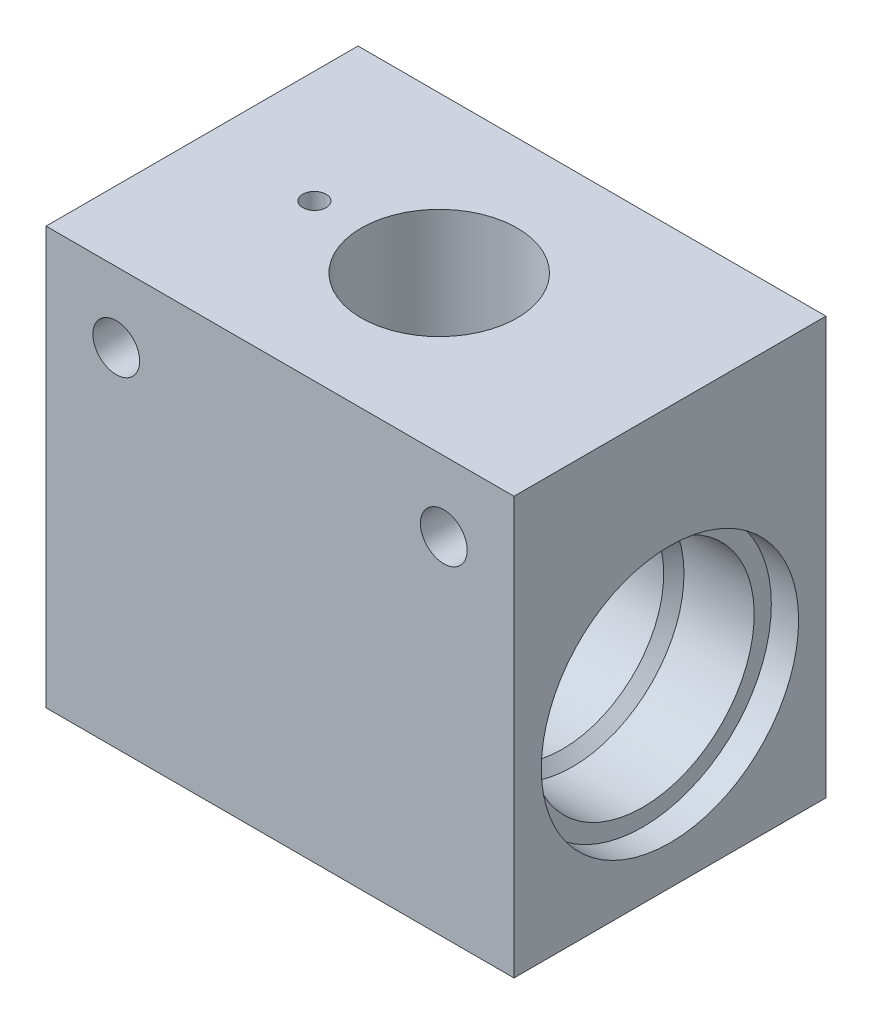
from build123d import *

# Parameters (mm, degrees)
BASE_EXTRUSION_DEPTH      = 20
BASE_EXTRUSION_DEPTH_BACK = 20
ESQUISSE1_W               = 60
ESQUISSE1_H               = 53.5
ESQUISSE3_R               = 16.5
ENL_V_MAT_EXTRU_1_DEPTH   = 3.5
ENL_V_START               = -3.5
ESQUISSE4_R               = 16.5
ENL_V_MAT_EXTRU_2_DEPTH   = 3.5
ESQUISSE6_R               = 13
ENL_V_MAT_EXTRU_3_DEPTH   = 81.339902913
ESQUISSE7_R               = 10
ENL_V_MAT_EXTRU_4_DEPTH   = 15
ESQUISSE8_R               = 14
ENL_V_MAT_EXTRU_5_DEPTH   = 17
ESQUISSE9_R               = 3
ENL_V_MAT_EXTRU_6_DEPTH   = 90.790032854
PER_AGE_D3_D              = 3
PER_AGE_D3_DEPTH          = 5
PER_AGE_D3_TIP            = 0.901290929


with BuildPart() as part:
    # Esquisse1 → Base-Extrusion (new, two sides: drawn at the far end of the back side and taken through both)
    with BuildSketch(Plane.XY.offset(-BASE_EXTRUSION_DEPTH_BACK)):
        with Locations((30, 26.75)):
            Rectangle(ESQUISSE1_W, ESQUISSE1_H)
    extrude(amount=BASE_EXTRUSION_DEPTH + BASE_EXTRUSION_DEPTH_BACK)

    # Esquisse3 → Enl_v. mat.-Extru.1 (cut)
    with BuildSketch(Plane.ZY):
        with Locations((0, 21.5)):
            Circle(ESQUISSE3_R)
    extrude(amount=-ENL_V_MAT_EXTRU_1_DEPTH, mode=Mode.SUBTRACT)

    # Esquisse4 → Enl_v. mat.-Extru.2 (cut)
    with BuildSketch(Plane(origin=(60, 0, 0), x_dir=(0, 0, -1), z_dir=(1, 0, 0)).offset(ENL_V_START)):
        with Locations(Location((0, 21.5, 0), (0, 0, 180))):
            Circle(ESQUISSE4_R)
    extrude(amount=ENL_V_MAT_EXTRU_2_DEPTH, mode=Mode.SUBTRACT)

    # Esquisse6 → Enl_v. mat.-Extru.3 (cut, through all)
    with BuildSketch(Plane(origin=(56.5, 0, 0), x_dir=(0, 0, -1), z_dir=(1, 0, 0))):
        with Locations(Location((0, 21.5, 0), (0, 0, 90))):
            Circle(ESQUISSE6_R)
    extrude(amount=-ENL_V_MAT_EXTRU_3_DEPTH, mode=Mode.SUBTRACT)

    # Esquisse7 → Enl_v. mat.-Extru.4 (cut)
    with BuildSketch(Plane(origin=(0, 53.5, 0), x_dir=(-1, 0, 0), z_dir=(0, 1, 0))):
        with Locations((-30.41353906, 0)):
            Circle(ESQUISSE7_R)
    extrude(amount=-ENL_V_MAT_EXTRU_4_DEPTH, mode=Mode.SUBTRACT)

    # Esquisse8 → Enl_v. mat.-Extru.5 (cut)
    with BuildSketch(Plane(origin=(0, 38.5, 0), x_dir=(-1, 0, 0), z_dir=(0, 1, 0))):
        with Locations((-30.41353906, 0)):
            Circle(ESQUISSE8_R)
    extrude(amount=-ENL_V_MAT_EXTRU_5_DEPTH, mode=Mode.SUBTRACT)

    # Esquisse9 → Enl_v. mat.-Extru.6 (cut, through all)
    with BuildSketch(Plane.XY.offset(20)):
        with Locations((9, 44.501529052)):
            Circle(ESQUISSE9_R)
        with Locations((51, 44.501529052)):
            Circle(ESQUISSE9_R)
    extrude(amount=-ENL_V_MAT_EXTRU_6_DEPTH, mode=Mode.SUBTRACT)

    # Per_age d3
    with Locations(Plane(origin=(0, 53.5, 0), x_dir=(-1, 0, 0), z_dir=(0, 1, 0))):
        with Locations((-14.41353906, 0)):
            Hole(PER_AGE_D3_D / 2, depth=PER_AGE_D3_DEPTH)
            with Locations((0, 0, -(PER_AGE_D3_DEPTH + PER_AGE_D3_TIP / 2))):  # 118° drill point
                Cone(0, PER_AGE_D3_D / 2, PER_AGE_D3_TIP, mode=Mode.SUBTRACT)

    # Esquisse28 → Enl_vement de mati_re-R_volution3 (revolve, cut)
    with BuildSketch(Plane.XY, mode=Mode.PRIVATE) as enl_vement_de_mati_re_r_volution3_sk:
        Polygon((56.5, 35.8), (47.5, 35.8), (46.2, 34.5), (56.5, 34.5), align=None)
        Polygon((3.5, 35.8), (12.5, 35.8), (13.8, 34.5), (3.5, 34.5), align=None)
    revolve(enl_vement_de_mati_re_r_volution3_sk.sketch.rotate(Axis((41.465054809, 21.5, 0), (1, 0, 0)), 180), axis=Axis((41.465054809, 21.5, 0), (1, 0, 0)), mode=Mode.SUBTRACT)


solid = part.part
